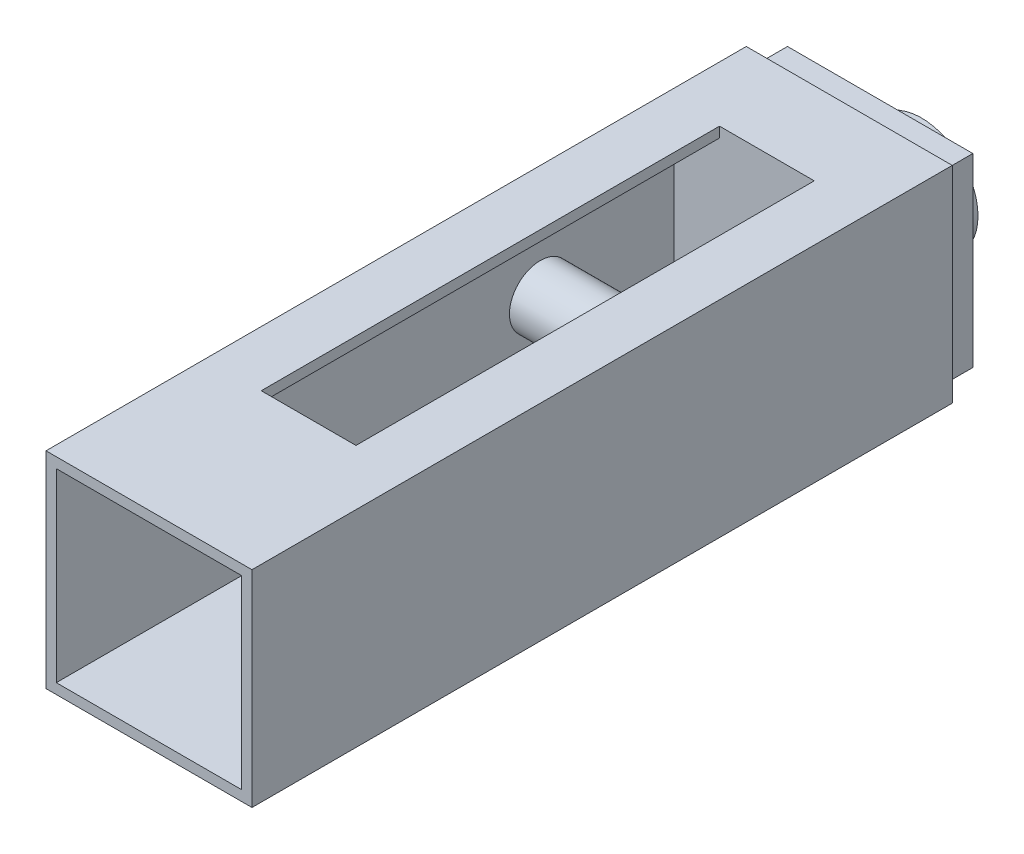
ISO-10303-21;
HEADER;
FILE_DESCRIPTION(('STEP AP214'),'2;1');
FILE_NAME('part.step','',(''),(''),'','','');
FILE_SCHEMA(('AUTOMOTIVE_DESIGN { 1 0 10303 214 1 1 1 1 }'));
ENDSEC;
DATA;
#1=APPLICATION_CONTEXT('core data for automotive mechanical design processes');
#2=APPLICATION_PROTOCOL_DEFINITION('international standard','automotive_design',2000,#1);
#3=PRODUCT_CONTEXT('',#1,'mechanical');
#4=PRODUCT('Part','Part','',(#3));
#5=PRODUCT_RELATED_PRODUCT_CATEGORY('part','',(#4));
#6=PRODUCT_DEFINITION_FORMATION('','',#4);
#7=PRODUCT_DEFINITION_CONTEXT('part definition',#1,'design');
#8=PRODUCT_DEFINITION('design','',#6,#7);
#9=PRODUCT_DEFINITION_SHAPE('','',#8);
#10=(LENGTH_UNIT() NAMED_UNIT(*) SI_UNIT(.MILLI.,.METRE.));
#11=(NAMED_UNIT(*) PLANE_ANGLE_UNIT() SI_UNIT($,.RADIAN.));
#12=(NAMED_UNIT(*) SI_UNIT($,.STERADIAN.) SOLID_ANGLE_UNIT());
#13=UNCERTAINTY_MEASURE_WITH_UNIT(LENGTH_MEASURE(1.E-05),#10,'distance_accuracy_value','');
#14=(GEOMETRIC_REPRESENTATION_CONTEXT(3) GLOBAL_UNCERTAINTY_ASSIGNED_CONTEXT((#13)) GLOBAL_UNIT_ASSIGNED_CONTEXT((#10,
#11,#12)) REPRESENTATION_CONTEXT('',''));
#15=CARTESIAN_POINT('',(0.,0.,0.));
#16=DIRECTION('',(0.,0.,1.));
#17=DIRECTION('',(1.,0.,0.));
#18=AXIS2_PLACEMENT_3D('',#15,#16,#17);
#19=CARTESIAN_POINT('',(4.048,-4.048,10.));
#20=DIRECTION('',(0.,0.,-1.));
#21=DIRECTION('',(-1.,0.,0.));
#22=AXIS2_PLACEMENT_3D('',#19,#20,#21);
#23=PLANE('',#22);
#24=CARTESIAN_POINT('',(0.,0.,10.));
#25=DIRECTION('',(0.,0.,-1.));
#26=DIRECTION('',(-1.,0.,0.));
#27=AXIS2_PLACEMENT_3D('',#24,#25,#26);
#28=CIRCLE('',#27,4.);
#29=CARTESIAN_POINT('',(-4.,0.,10.));
#30=VERTEX_POINT('',#29);
#31=EDGE_CURVE('E18',#30,#30,#28,.F.);
#32=ORIENTED_EDGE('',*,*,#31,.F.);
#33=EDGE_LOOP('',(#32));
#34=FACE_BOUND('',#33,.T.);
#35=ADVANCED_FACE('F14',(#34),#23,.T.);
#36=CARTESIAN_POINT('',(0.,0.,10.));
#37=DIRECTION('',(0.,0.,-1.));
#38=DIRECTION('',(-1.,0.,0.));
#39=AXIS2_PLACEMENT_3D('',#36,#37,#38);
#40=CYLINDRICAL_SURFACE('',#39,4.);
#41=CARTESIAN_POINT('',(0.,0.,0.));
#42=DIRECTION('',(0.,0.,-1.));
#43=DIRECTION('',(-1.,0.,0.));
#44=AXIS2_PLACEMENT_3D('',#41,#42,#43);
#45=CIRCLE('',#44,4.);
#46=CARTESIAN_POINT('',(-4.,0.,0.));
#47=VERTEX_POINT('',#46);
#48=EDGE_CURVE('E338',#47,#47,#45,.F.);
#49=ORIENTED_EDGE('',*,*,#48,.F.);
#50=EDGE_LOOP('',(#49));
#51=FACE_BOUND('',#50,.T.);
#52=ORIENTED_EDGE('',*,*,#31,.T.);
#53=EDGE_LOOP('',(#52));
#54=FACE_BOUND('',#53,.T.);
#55=ADVANCED_FACE('F345',(#51,#54),#40,.F.);
#56=CARTESIAN_POINT('',(-5.566,-5.566,0.));
#57=DIRECTION('',(0.,0.,1.));
#58=DIRECTION('',(1.,0.,0.));
#59=AXIS2_PLACEMENT_3D('',#56,#57,#58);
#60=PLANE('',#59);
#61=ORIENTED_EDGE('',*,*,#48,.T.);
#62=EDGE_LOOP('',(#61));
#63=FACE_BOUND('',#62,.T.);
#64=CARTESIAN_POINT('',(0.,0.,0.));
#65=DIRECTION('',(0.,0.,1.));
#66=DIRECTION('',(1.,0.,0.));
#67=AXIS2_PLACEMENT_3D('',#64,#65,#66);
#68=CIRCLE('',#67,5.5);
#69=CARTESIAN_POINT('',(5.5,0.,0.));
#70=VERTEX_POINT('',#69);
#71=EDGE_CURVE('E336',#70,#70,#68,.T.);
#72=ORIENTED_EDGE('',*,*,#71,.F.);
#73=EDGE_LOOP('',(#72));
#74=FACE_BOUND('',#73,.T.);
#75=ADVANCED_FACE('F355',(#63,#74),#60,.F.);
#76=CARTESIAN_POINT('',(0.,0.,0.));
#77=DIRECTION('',(0.,0.,1.));
#78=DIRECTION('',(1.,0.,0.));
#79=AXIS2_PLACEMENT_3D('',#76,#77,#78);
#80=CYLINDRICAL_SURFACE('',#79,5.5);
#81=ORIENTED_EDGE('',*,*,#71,.T.);
#82=EDGE_LOOP('',(#81));
#83=FACE_BOUND('',#82,.T.);
#84=CARTESIAN_POINT('',(0.,0.,4.));
#85=DIRECTION('',(0.,0.,1.));
#86=DIRECTION('',(1.,0.,0.));
#87=AXIS2_PLACEMENT_3D('',#84,#85,#86);
#88=CIRCLE('',#87,5.5);
#89=CARTESIAN_POINT('',(5.5,0.,4.));
#90=VERTEX_POINT('',#89);
#91=EDGE_CURVE('E329',#90,#90,#88,.T.);
#92=ORIENTED_EDGE('',*,*,#91,.F.);
#93=EDGE_LOOP('',(#92));
#94=FACE_BOUND('',#93,.T.);
#95=ADVANCED_FACE('F439',(#83,#94),#80,.T.);
#96=CARTESIAN_POINT('',(-9.,0.,28.));
#97=DIRECTION('',(1.,0.,0.));
#98=DIRECTION('',(0.,0.,-1.));
#99=AXIS2_PLACEMENT_3D('',#96,#97,#98);
#100=CYLINDRICAL_SURFACE('',#99,3.);
#101=CARTESIAN_POINT('',(9.,0.,28.));
#102=DIRECTION('',(1.,0.,0.));
#103=DIRECTION('',(0.,0.,-1.));
#104=AXIS2_PLACEMENT_3D('',#101,#102,#103);
#105=CIRCLE('',#104,3.);
#106=CARTESIAN_POINT('',(9.,0.,25.));
#107=VERTEX_POINT('',#106);
#108=EDGE_CURVE('E325',#107,#107,#105,.T.);
#109=ORIENTED_EDGE('',*,*,#108,.F.);
#110=EDGE_LOOP('',(#109));
#111=FACE_BOUND('',#110,.T.);
#112=CARTESIAN_POINT('',(-9.,0.,28.));
#113=DIRECTION('',(1.,0.,0.));
#114=DIRECTION('',(0.,0.,-1.));
#115=AXIS2_PLACEMENT_3D('',#112,#113,#114);
#116=CIRCLE('',#115,3.);
#117=CARTESIAN_POINT('',(-9.,0.,25.));
#118=VERTEX_POINT('',#117);
#119=EDGE_CURVE('E327',#118,#118,#116,.F.);
#120=ORIENTED_EDGE('',*,*,#119,.F.);
#121=EDGE_LOOP('',(#120));
#122=FACE_BOUND('',#121,.T.);
#123=ADVANCED_FACE('F435',(#111,#122),#100,.T.);
#124=CARTESIAN_POINT('',(9.,-9.,4.));
#125=DIRECTION('',(0.,0.,-1.));
#126=DIRECTION('',(-1.,0.,0.));
#127=AXIS2_PLACEMENT_3D('',#124,#125,#126);
#128=PLANE('',#127);
#129=ORIENTED_EDGE('',*,*,#91,.T.);
#130=EDGE_LOOP('',(#129));
#131=FACE_BOUND('',#130,.T.);
#132=DIRECTION('',(0.,-1.,0.));
#133=VECTOR('',#132,1.);
#134=CARTESIAN_POINT('',(-9.,0.,4.));
#135=LINE('',#134,#133);
#136=CARTESIAN_POINT('',(-9.,9.,4.));
#137=VERTEX_POINT('',#136);
#138=CARTESIAN_POINT('',(-9.,-9.,4.));
#139=VERTEX_POINT('',#138);
#140=EDGE_CURVE('E119',#137,#139,#135,.T.);
#141=ORIENTED_EDGE('',*,*,#140,.F.);
#142=DIRECTION('',(1.,0.,0.));
#143=VECTOR('',#142,1.);
#144=CARTESIAN_POINT('',(0.,9.,4.));
#145=LINE('',#144,#143);
#146=CARTESIAN_POINT('',(9.,9.,4.));
#147=VERTEX_POINT('',#146);
#148=EDGE_CURVE('E124',#147,#137,#145,.F.);
#149=ORIENTED_EDGE('',*,*,#148,.F.);
#150=DIRECTION('',(0.,-1.,0.));
#151=VECTOR('',#150,1.);
#152=CARTESIAN_POINT('',(9.,0.,4.));
#153=LINE('',#152,#151);
#154=CARTESIAN_POINT('',(9.,-9.,4.));
#155=VERTEX_POINT('',#154);
#156=EDGE_CURVE('E309',#155,#147,#153,.F.);
#157=ORIENTED_EDGE('',*,*,#156,.F.);
#158=DIRECTION('',(1.,0.,0.));
#159=VECTOR('',#158,1.);
#160=CARTESIAN_POINT('',(0.,-9.,4.));
#161=LINE('',#160,#159);
#162=EDGE_CURVE('E312',#139,#155,#161,.T.);
#163=ORIENTED_EDGE('',*,*,#162,.F.);
#164=EDGE_LOOP('',(#141,#149,#157,#163));
#165=FACE_BOUND('',#164,.T.);
#166=ADVANCED_FACE('F438',(#131,#165),#128,.T.);
#167=CARTESIAN_POINT('',(-9.,-9.,15.));
#168=DIRECTION('',(-1.,0.,0.));
#169=DIRECTION('',(0.,0.,1.));
#170=AXIS2_PLACEMENT_3D('',#167,#168,#169);
#171=PLANE('',#170);
#172=DIRECTION('',(0.,0.,1.));
#173=VECTOR('',#172,1.);
#174=CARTESIAN_POINT('',(-9.,-9.,41.));
#175=LINE('',#174,#173);
#176=CARTESIAN_POINT('',(-9.,-9.,75.));
#177=VERTEX_POINT('',#176);
#178=CARTESIAN_POINT('',(-9.,-9.,15.));
#179=VERTEX_POINT('',#178);
#180=EDGE_CURVE('E135',#177,#179,#175,.F.);
#181=ORIENTED_EDGE('',*,*,#180,.T.);
#182=DIRECTION('',(0.,1.,0.));
#183=VECTOR('',#182,1.);
#184=CARTESIAN_POINT('',(-9.,0.,15.));
#185=LINE('',#184,#183);
#186=CARTESIAN_POINT('',(-9.,9.,15.));
#187=VERTEX_POINT('',#186);
#188=EDGE_CURVE('E284',#187,#179,#185,.F.);
#189=ORIENTED_EDGE('',*,*,#188,.F.);
#190=DIRECTION('',(0.,0.,-1.));
#191=VECTOR('',#190,1.);
#192=CARTESIAN_POINT('',(-9.,9.,41.));
#193=LINE('',#192,#191);
#194=CARTESIAN_POINT('',(-9.,9.,75.));
#195=VERTEX_POINT('',#194);
#196=EDGE_CURVE('E322',#195,#187,#193,.T.);
#197=ORIENTED_EDGE('',*,*,#196,.F.);
#198=DIRECTION('',(0.,-1.,0.));
#199=VECTOR('',#198,1.);
#200=CARTESIAN_POINT('',(-9.,0.,75.));
#201=LINE('',#200,#199);
#202=EDGE_CURVE('E9',#195,#177,#201,.T.);
#203=ORIENTED_EDGE('',*,*,#202,.T.);
#204=EDGE_LOOP('',(#181,#189,#197,#203));
#205=FACE_BOUND('',#204,.T.);
#206=ORIENTED_EDGE('',*,*,#119,.T.);
#207=EDGE_LOOP('',(#206));
#208=FACE_BOUND('',#207,.T.);
#209=ADVANCED_FACE('F422',(#205,#208),#171,.F.);
#210=CARTESIAN_POINT('',(9.,-9.,15.));
#211=DIRECTION('',(-1.,0.,0.));
#212=DIRECTION('',(0.,0.,1.));
#213=AXIS2_PLACEMENT_3D('',#210,#211,#212);
#214=PLANE('',#213);
#215=DIRECTION('',(0.,0.,-1.));
#216=VECTOR('',#215,1.);
#217=CARTESIAN_POINT('',(9.,9.,41.));
#218=LINE('',#217,#216);
#219=CARTESIAN_POINT('',(9.,9.,75.));
#220=VERTEX_POINT('',#219);
#221=CARTESIAN_POINT('',(9.,9.,15.));
#222=VERTEX_POINT('',#221);
#223=EDGE_CURVE('E33',#220,#222,#218,.T.);
#224=ORIENTED_EDGE('',*,*,#223,.T.);
#225=DIRECTION('',(0.,-1.,0.));
#226=VECTOR('',#225,1.);
#227=CARTESIAN_POINT('',(9.,0.,15.));
#228=LINE('',#227,#226);
#229=CARTESIAN_POINT('',(9.,-9.,15.));
#230=VERTEX_POINT('',#229);
#231=EDGE_CURVE('E292',#230,#222,#228,.F.);
#232=ORIENTED_EDGE('',*,*,#231,.F.);
#233=DIRECTION('',(0.,0.,1.));
#234=VECTOR('',#233,1.);
#235=CARTESIAN_POINT('',(9.,-9.,41.));
#236=LINE('',#235,#234);
#237=CARTESIAN_POINT('',(9.,-9.,75.));
#238=VERTEX_POINT('',#237);
#239=EDGE_CURVE('E129',#238,#230,#236,.F.);
#240=ORIENTED_EDGE('',*,*,#239,.F.);
#241=DIRECTION('',(0.,-1.,0.));
#242=VECTOR('',#241,1.);
#243=CARTESIAN_POINT('',(9.,0.,75.));
#244=LINE('',#243,#242);
#245=EDGE_CURVE('E210',#238,#220,#244,.F.);
#246=ORIENTED_EDGE('',*,*,#245,.T.);
#247=EDGE_LOOP('',(#224,#232,#240,#246));
#248=FACE_BOUND('',#247,.T.);
#249=ORIENTED_EDGE('',*,*,#108,.T.);
#250=EDGE_LOOP('',(#249));
#251=FACE_BOUND('',#250,.T.);
#252=ADVANCED_FACE('F429',(#248,#251),#214,.T.);
#253=CARTESIAN_POINT('',(4.6,-9.,67.));
#254=DIRECTION('',(0.,-1.,0.));
#255=DIRECTION('',(0.,0.,-1.));
#256=AXIS2_PLACEMENT_3D('',#253,#254,#255);
#257=PLANE('',#256);
#258=DIRECTION('',(0.,0.,-1.));
#259=VECTOR('',#258,1.);
#260=CARTESIAN_POINT('',(4.6,-9.,41.));
#261=LINE('',#260,#259);
#262=CARTESIAN_POINT('',(4.6,-9.,59.5));
#263=VERTEX_POINT('',#262);
#264=CARTESIAN_POINT('',(4.6,-9.,15.));
#265=VERTEX_POINT('',#264);
#266=EDGE_CURVE('E301',#263,#265,#261,.T.);
#267=ORIENTED_EDGE('',*,*,#266,.F.);
#268=DIRECTION('',(1.,0.,0.));
#269=VECTOR('',#268,1.);
#270=CARTESIAN_POINT('',(-4.6,-9.,59.5));
#271=LINE('',#270,#269);
#272=CARTESIAN_POINT('',(-4.6,-9.,59.5));
#273=VERTEX_POINT('',#272);
#274=EDGE_CURVE('E185',#273,#263,#271,.T.);
#275=ORIENTED_EDGE('',*,*,#274,.F.);
#276=DIRECTION('',(0.,0.,1.));
#277=VECTOR('',#276,1.);
#278=CARTESIAN_POINT('',(-4.6,-9.,41.));
#279=LINE('',#278,#277);
#280=CARTESIAN_POINT('',(-4.6,-9.,15.));
#281=VERTEX_POINT('',#280);
#282=EDGE_CURVE('E299',#281,#273,#279,.T.);
#283=ORIENTED_EDGE('',*,*,#282,.F.);
#284=DIRECTION('',(-1.,0.,0.));
#285=VECTOR('',#284,1.);
#286=CARTESIAN_POINT('',(0.,-9.,15.));
#287=LINE('',#286,#285);
#288=EDGE_CURVE('E281',#179,#281,#287,.F.);
#289=ORIENTED_EDGE('',*,*,#288,.F.);
#290=ORIENTED_EDGE('',*,*,#180,.F.);
#291=DIRECTION('',(1.,0.,0.));
#292=VECTOR('',#291,1.);
#293=CARTESIAN_POINT('',(0.,-9.,75.));
#294=LINE('',#293,#292);
#295=EDGE_CURVE('E212',#177,#238,#294,.T.);
#296=ORIENTED_EDGE('',*,*,#295,.T.);
#297=ORIENTED_EDGE('',*,*,#239,.T.);
#298=DIRECTION('',(-1.,0.,0.));
#299=VECTOR('',#298,1.);
#300=CARTESIAN_POINT('',(0.,-9.,15.));
#301=LINE('',#300,#299);
#302=EDGE_CURVE('E295',#265,#230,#301,.F.);
#303=ORIENTED_EDGE('',*,*,#302,.F.);
#304=EDGE_LOOP('',(#267,#275,#283,#289,#290,#296,#297,#303));
#305=FACE_BOUND('',#304,.T.);
#306=ADVANCED_FACE('F425',(#305),#257,.F.);
#307=CARTESIAN_POINT('',(-9.,9.,67.));
#308=DIRECTION('',(0.,-1.,0.));
#309=DIRECTION('',(0.,0.,-1.));
#310=AXIS2_PLACEMENT_3D('',#307,#308,#309);
#311=PLANE('',#310);
#312=DIRECTION('',(0.,0.,-1.));
#313=VECTOR('',#312,1.);
#314=CARTESIAN_POINT('',(-4.6,9.,41.));
#315=LINE('',#314,#313);
#316=CARTESIAN_POINT('',(-4.6,9.,59.5));
#317=VERTEX_POINT('',#316);
#318=CARTESIAN_POINT('',(-4.6,9.,15.));
#319=VERTEX_POINT('',#318);
#320=EDGE_CURVE('E272',#317,#319,#315,.T.);
#321=ORIENTED_EDGE('',*,*,#320,.F.);
#322=DIRECTION('',(-1.,0.,0.));
#323=VECTOR('',#322,1.);
#324=CARTESIAN_POINT('',(4.6,9.,59.5));
#325=LINE('',#324,#323);
#326=CARTESIAN_POINT('',(4.6,9.,59.5));
#327=VERTEX_POINT('',#326);
#328=EDGE_CURVE('E206',#327,#317,#325,.T.);
#329=ORIENTED_EDGE('',*,*,#328,.F.);
#330=DIRECTION('',(0.,0.,1.));
#331=VECTOR('',#330,1.);
#332=CARTESIAN_POINT('',(4.6,9.,41.));
#333=LINE('',#332,#331);
#334=CARTESIAN_POINT('',(4.6,9.,15.));
#335=VERTEX_POINT('',#334);
#336=EDGE_CURVE('E274',#335,#327,#333,.T.);
#337=ORIENTED_EDGE('',*,*,#336,.F.);
#338=DIRECTION('',(1.,0.,0.));
#339=VECTOR('',#338,1.);
#340=CARTESIAN_POINT('',(0.,9.,15.));
#341=LINE('',#340,#339);
#342=EDGE_CURVE('E290',#222,#335,#341,.F.);
#343=ORIENTED_EDGE('',*,*,#342,.F.);
#344=ORIENTED_EDGE('',*,*,#223,.F.);
#345=DIRECTION('',(1.,0.,0.));
#346=VECTOR('',#345,1.);
#347=CARTESIAN_POINT('',(0.,9.,75.));
#348=LINE('',#347,#346);
#349=EDGE_CURVE('E24',#220,#195,#348,.F.);
#350=ORIENTED_EDGE('',*,*,#349,.T.);
#351=ORIENTED_EDGE('',*,*,#196,.T.);
#352=DIRECTION('',(1.,0.,0.));
#353=VECTOR('',#352,1.);
#354=CARTESIAN_POINT('',(0.,9.,15.));
#355=LINE('',#354,#353);
#356=EDGE_CURVE('E287',#319,#187,#355,.F.);
#357=ORIENTED_EDGE('',*,*,#356,.F.);
#358=EDGE_LOOP('',(#321,#329,#337,#343,#344,#350,#351,#357));
#359=FACE_BOUND('',#358,.T.);
#360=ADVANCED_FACE('F418',(#359),#311,.T.);
#361=CARTESIAN_POINT('',(-9.,9.,7.));
#362=DIRECTION('',(0.,-1.,0.));
#363=DIRECTION('',(0.,0.,-1.));
#364=AXIS2_PLACEMENT_3D('',#361,#362,#363);
#365=PLANE('',#364);
#366=DIRECTION('',(1.,0.,0.));
#367=VECTOR('',#366,1.);
#368=CARTESIAN_POINT('',(0.,9.,7.));
#369=LINE('',#368,#367);
#370=CARTESIAN_POINT('',(9.,9.,7.));
#371=VERTEX_POINT('',#370);
#372=CARTESIAN_POINT('',(-9.,9.,7.));
#373=VERTEX_POINT('',#372);
#374=EDGE_CURVE('E266',#371,#373,#369,.F.);
#375=ORIENTED_EDGE('',*,*,#374,.F.);
#376=DIRECTION('',(0.,0.,-1.));
#377=VECTOR('',#376,1.);
#378=CARTESIAN_POINT('',(9.,9.,5.5));
#379=LINE('',#378,#377);
#380=EDGE_CURVE('E306',#147,#371,#379,.F.);
#381=ORIENTED_EDGE('',*,*,#380,.F.);
#382=ORIENTED_EDGE('',*,*,#148,.T.);
#383=DIRECTION('',(0.,0.,-1.));
#384=VECTOR('',#383,1.);
#385=CARTESIAN_POINT('',(-9.,9.,5.5));
#386=LINE('',#385,#384);
#387=EDGE_CURVE('E319',#373,#137,#386,.T.);
#388=ORIENTED_EDGE('',*,*,#387,.F.);
#389=EDGE_LOOP('',(#375,#381,#382,#388));
#390=FACE_BOUND('',#389,.T.);
#391=ADVANCED_FACE('F455',(#390),#365,.F.);
#392=CARTESIAN_POINT('',(-9.,-9.,4.));
#393=DIRECTION('',(-1.,0.,0.));
#394=DIRECTION('',(0.,0.,1.));
#395=AXIS2_PLACEMENT_3D('',#392,#393,#394);
#396=PLANE('',#395);
#397=DIRECTION('',(0.,0.,-1.));
#398=VECTOR('',#397,1.);
#399=CARTESIAN_POINT('',(-9.,-9.,5.5));
#400=LINE('',#399,#398);
#401=CARTESIAN_POINT('',(-9.,-9.,7.));
#402=VERTEX_POINT('',#401);
#403=EDGE_CURVE('E315',#402,#139,#400,.T.);
#404=ORIENTED_EDGE('',*,*,#403,.F.);
#405=DIRECTION('',(0.,1.,0.));
#406=VECTOR('',#405,1.);
#407=CARTESIAN_POINT('',(-9.,0.,7.));
#408=LINE('',#407,#406);
#409=EDGE_CURVE('E263',#373,#402,#408,.F.);
#410=ORIENTED_EDGE('',*,*,#409,.F.);
#411=ORIENTED_EDGE('',*,*,#387,.T.);
#412=ORIENTED_EDGE('',*,*,#140,.T.);
#413=EDGE_LOOP('',(#404,#410,#411,#412));
#414=FACE_BOUND('',#413,.T.);
#415=ADVANCED_FACE('F458',(#414),#396,.T.);
#416=CARTESIAN_POINT('',(-9.,-9.,7.));
#417=DIRECTION('',(0.,-1.,0.));
#418=DIRECTION('',(0.,0.,-1.));
#419=AXIS2_PLACEMENT_3D('',#416,#417,#418);
#420=PLANE('',#419);
#421=DIRECTION('',(0.,0.,1.));
#422=VECTOR('',#421,1.);
#423=CARTESIAN_POINT('',(9.,-9.,5.5));
#424=LINE('',#423,#422);
#425=CARTESIAN_POINT('',(9.,-9.,7.));
#426=VERTEX_POINT('',#425);
#427=EDGE_CURVE('E303',#426,#155,#424,.F.);
#428=ORIENTED_EDGE('',*,*,#427,.F.);
#429=DIRECTION('',(-1.,0.,0.));
#430=VECTOR('',#429,1.);
#431=CARTESIAN_POINT('',(0.,-9.,7.));
#432=LINE('',#431,#430);
#433=EDGE_CURVE('E260',#402,#426,#432,.F.);
#434=ORIENTED_EDGE('',*,*,#433,.F.);
#435=ORIENTED_EDGE('',*,*,#403,.T.);
#436=ORIENTED_EDGE('',*,*,#162,.T.);
#437=EDGE_LOOP('',(#428,#434,#435,#436));
#438=FACE_BOUND('',#437,.T.);
#439=ADVANCED_FACE('F461',(#438),#420,.T.);
#440=CARTESIAN_POINT('',(9.,-9.,4.));
#441=DIRECTION('',(-1.,0.,0.));
#442=DIRECTION('',(0.,0.,1.));
#443=AXIS2_PLACEMENT_3D('',#440,#441,#442);
#444=PLANE('',#443);
#445=DIRECTION('',(0.,-1.,0.));
#446=VECTOR('',#445,1.);
#447=CARTESIAN_POINT('',(9.,0.,7.));
#448=LINE('',#447,#446);
#449=EDGE_CURVE('E257',#426,#371,#448,.F.);
#450=ORIENTED_EDGE('',*,*,#449,.F.);
#451=ORIENTED_EDGE('',*,*,#427,.T.);
#452=ORIENTED_EDGE('',*,*,#156,.T.);
#453=ORIENTED_EDGE('',*,*,#380,.T.);
#454=EDGE_LOOP('',(#450,#451,#452,#453));
#455=FACE_BOUND('',#454,.T.);
#456=ADVANCED_FACE('F464',(#455),#444,.F.);
#457=CARTESIAN_POINT('',(4.6,-10.,15.));
#458=DIRECTION('',(-1.,0.,0.));
#459=DIRECTION('',(0.,0.,1.));
#460=AXIS2_PLACEMENT_3D('',#457,#458,#459);
#461=PLANE('',#460);
#462=DIRECTION('',(0.,0.,-1.));
#463=VECTOR('',#462,1.);
#464=CARTESIAN_POINT('',(4.6,-10.,41.));
#465=LINE('',#464,#463);
#466=CARTESIAN_POINT('',(4.6,-10.,59.5));
#467=VERTEX_POINT('',#466);
#468=CARTESIAN_POINT('',(4.6,-10.,15.));
#469=VERTEX_POINT('',#468);
#470=EDGE_CURVE('E165',#467,#469,#465,.T.);
#471=ORIENTED_EDGE('',*,*,#470,.F.);
#472=DIRECTION('',(0.,-1.,0.));
#473=VECTOR('',#472,1.);
#474=CARTESIAN_POINT('',(4.6,-9.,59.5));
#475=LINE('',#474,#473);
#476=EDGE_CURVE('E168',#263,#467,#475,.T.);
#477=ORIENTED_EDGE('',*,*,#476,.F.);
#478=ORIENTED_EDGE('',*,*,#266,.T.);
#479=DIRECTION('',(0.,-1.,0.));
#480=VECTOR('',#479,1.);
#481=CARTESIAN_POINT('',(4.6,0.,15.));
#482=LINE('',#481,#480);
#483=EDGE_CURVE('E171',#469,#265,#482,.F.);
#484=ORIENTED_EDGE('',*,*,#483,.F.);
#485=EDGE_LOOP('',(#471,#477,#478,#484));
#486=FACE_BOUND('',#485,.T.);
#487=ADVANCED_FACE('F167',(#486),#461,.T.);
#488=CARTESIAN_POINT('',(-4.6,-10.,67.));
#489=DIRECTION('',(1.,0.,0.));
#490=DIRECTION('',(0.,0.,-1.));
#491=AXIS2_PLACEMENT_3D('',#488,#489,#490);
#492=PLANE('',#491);
#493=ORIENTED_EDGE('',*,*,#282,.T.);
#494=DIRECTION('',(0.,1.,0.));
#495=VECTOR('',#494,1.);
#496=CARTESIAN_POINT('',(-4.6,-10.,59.5));
#497=LINE('',#496,#495);
#498=CARTESIAN_POINT('',(-4.6,-10.,59.5));
#499=VERTEX_POINT('',#498);
#500=EDGE_CURVE('E192',#499,#273,#497,.T.);
#501=ORIENTED_EDGE('',*,*,#500,.F.);
#502=DIRECTION('',(0.,0.,1.));
#503=VECTOR('',#502,1.);
#504=CARTESIAN_POINT('',(-4.6,-10.,41.));
#505=LINE('',#504,#503);
#506=CARTESIAN_POINT('',(-4.6,-10.,15.));
#507=VERTEX_POINT('',#506);
#508=EDGE_CURVE('E190',#507,#499,#505,.T.);
#509=ORIENTED_EDGE('',*,*,#508,.F.);
#510=DIRECTION('',(0.,1.,0.));
#511=VECTOR('',#510,1.);
#512=CARTESIAN_POINT('',(-4.6,0.,15.));
#513=LINE('',#512,#511);
#514=EDGE_CURVE('E279',#281,#507,#513,.F.);
#515=ORIENTED_EDGE('',*,*,#514,.F.);
#516=EDGE_LOOP('',(#493,#501,#509,#515));
#517=FACE_BOUND('',#516,.T.);
#518=ADVANCED_FACE('F427',(#517),#492,.T.);
#519=CARTESIAN_POINT('',(9.,-10.,15.));
#520=DIRECTION('',(0.,0.,-1.));
#521=DIRECTION('',(-1.,0.,0.));
#522=AXIS2_PLACEMENT_3D('',#519,#520,#521);
#523=PLANE('',#522);
#524=ORIENTED_EDGE('',*,*,#514,.T.);
#525=DIRECTION('',(-1.,0.,0.));
#526=VECTOR('',#525,1.);
#527=CARTESIAN_POINT('',(0.,-10.,15.));
#528=LINE('',#527,#526);
#529=EDGE_CURVE('E176',#469,#507,#528,.T.);
#530=ORIENTED_EDGE('',*,*,#529,.F.);
#531=ORIENTED_EDGE('',*,*,#483,.T.);
#532=ORIENTED_EDGE('',*,*,#302,.T.);
#533=ORIENTED_EDGE('',*,*,#231,.T.);
#534=ORIENTED_EDGE('',*,*,#342,.T.);
#535=DIRECTION('',(0.,-1.,0.));
#536=VECTOR('',#535,1.);
#537=CARTESIAN_POINT('',(4.6,9.5,15.));
#538=LINE('',#537,#536);
#539=CARTESIAN_POINT('',(4.6,10.,15.));
#540=VERTEX_POINT('',#539);
#541=EDGE_CURVE('E276',#540,#335,#538,.T.);
#542=ORIENTED_EDGE('',*,*,#541,.F.);
#543=DIRECTION('',(1.,0.,0.));
#544=VECTOR('',#543,1.);
#545=CARTESIAN_POINT('',(0.,10.,15.));
#546=LINE('',#545,#544);
#547=CARTESIAN_POINT('',(-4.6,10.,15.));
#548=VERTEX_POINT('',#547);
#549=EDGE_CURVE('E239',#548,#540,#546,.T.);
#550=ORIENTED_EDGE('',*,*,#549,.F.);
#551=DIRECTION('',(0.,1.,0.));
#552=VECTOR('',#551,1.);
#553=CARTESIAN_POINT('',(-4.6,9.5,15.));
#554=LINE('',#553,#552);
#555=EDGE_CURVE('E269',#319,#548,#554,.T.);
#556=ORIENTED_EDGE('',*,*,#555,.F.);
#557=ORIENTED_EDGE('',*,*,#356,.T.);
#558=ORIENTED_EDGE('',*,*,#188,.T.);
#559=ORIENTED_EDGE('',*,*,#288,.T.);
#560=EDGE_LOOP('',(#524,#530,#531,#532,#533,#534,#542,#550,#556,#557,#558,#559));
#561=FACE_BOUND('',#560,.T.);
#562=ADVANCED_FACE('F415',(#561),#523,.F.);
#563=CARTESIAN_POINT('',(4.6,9.,15.));
#564=DIRECTION('',(-1.,0.,0.));
#565=DIRECTION('',(0.,0.,1.));
#566=AXIS2_PLACEMENT_3D('',#563,#564,#565);
#567=PLANE('',#566);
#568=ORIENTED_EDGE('',*,*,#336,.T.);
#569=DIRECTION('',(0.,-1.,0.));
#570=VECTOR('',#569,1.);
#571=CARTESIAN_POINT('',(4.6,10.,59.5));
#572=LINE('',#571,#570);
#573=CARTESIAN_POINT('',(4.6,10.,59.5));
#574=VERTEX_POINT('',#573);
#575=EDGE_CURVE('E203',#574,#327,#572,.T.);
#576=ORIENTED_EDGE('',*,*,#575,.F.);
#577=DIRECTION('',(0.,0.,1.));
#578=VECTOR('',#577,1.);
#579=CARTESIAN_POINT('',(4.6,10.,41.));
#580=LINE('',#579,#578);
#581=EDGE_CURVE('E237',#540,#574,#580,.T.);
#582=ORIENTED_EDGE('',*,*,#581,.F.);
#583=ORIENTED_EDGE('',*,*,#541,.T.);
#584=EDGE_LOOP('',(#568,#576,#582,#583));
#585=FACE_BOUND('',#584,.T.);
#586=ADVANCED_FACE('F394',(#585),#567,.T.);
#587=CARTESIAN_POINT('',(-4.6,9.,67.));
#588=DIRECTION('',(1.,0.,0.));
#589=DIRECTION('',(0.,0.,-1.));
#590=AXIS2_PLACEMENT_3D('',#587,#588,#589);
#591=PLANE('',#590);
#592=DIRECTION('',(0.,0.,-1.));
#593=VECTOR('',#592,1.);
#594=CARTESIAN_POINT('',(-4.6,10.,41.));
#595=LINE('',#594,#593);
#596=CARTESIAN_POINT('',(-4.6,10.,59.5));
#597=VERTEX_POINT('',#596);
#598=EDGE_CURVE('E235',#597,#548,#595,.T.);
#599=ORIENTED_EDGE('',*,*,#598,.F.);
#600=DIRECTION('',(0.,1.,0.));
#601=VECTOR('',#600,1.);
#602=CARTESIAN_POINT('',(-4.6,9.,59.5));
#603=LINE('',#602,#601);
#604=EDGE_CURVE('E197',#317,#597,#603,.T.);
#605=ORIENTED_EDGE('',*,*,#604,.F.);
#606=ORIENTED_EDGE('',*,*,#320,.T.);
#607=ORIENTED_EDGE('',*,*,#555,.T.);
#608=EDGE_LOOP('',(#599,#605,#606,#607));
#609=FACE_BOUND('',#608,.T.);
#610=ADVANCED_FACE('F385',(#609),#591,.T.);
#611=CARTESIAN_POINT('',(-10.,10.,7.));
#612=DIRECTION('',(0.,0.,1.));
#613=DIRECTION('',(0.,-1.,0.));
#614=AXIS2_PLACEMENT_3D('',#611,#612,#613);
#615=PLANE('',#614);
#616=ORIENTED_EDGE('',*,*,#433,.T.);
#617=ORIENTED_EDGE('',*,*,#449,.T.);
#618=ORIENTED_EDGE('',*,*,#374,.T.);
#619=ORIENTED_EDGE('',*,*,#409,.T.);
#620=EDGE_LOOP('',(#616,#617,#618,#619));
#621=FACE_BOUND('',#620,.T.);
#622=DIRECTION('',(-1.,0.,0.));
#623=VECTOR('',#622,1.);
#624=CARTESIAN_POINT('',(0.,10.,7.));
#625=LINE('',#624,#623);
#626=CARTESIAN_POINT('',(10.,10.,7.));
#627=VERTEX_POINT('',#626);
#628=CARTESIAN_POINT('',(-10.,10.,7.));
#629=VERTEX_POINT('',#628);
#630=EDGE_CURVE('E245',#627,#629,#625,.T.);
#631=ORIENTED_EDGE('',*,*,#630,.F.);
#632=DIRECTION('',(0.,-1.,0.));
#633=VECTOR('',#632,1.);
#634=CARTESIAN_POINT('',(10.,0.,7.));
#635=LINE('',#634,#633);
#636=CARTESIAN_POINT('',(10.,-10.,7.));
#637=VERTEX_POINT('',#636);
#638=EDGE_CURVE('E248',#637,#627,#635,.F.);
#639=ORIENTED_EDGE('',*,*,#638,.F.);
#640=DIRECTION('',(1.,0.,0.));
#641=VECTOR('',#640,1.);
#642=CARTESIAN_POINT('',(0.,-10.,7.));
#643=LINE('',#642,#641);
#644=CARTESIAN_POINT('',(-10.,-10.,7.));
#645=VERTEX_POINT('',#644);
#646=EDGE_CURVE('E177',#645,#637,#643,.T.);
#647=ORIENTED_EDGE('',*,*,#646,.F.);
#648=DIRECTION('',(0.,1.,0.));
#649=VECTOR('',#648,1.);
#650=CARTESIAN_POINT('',(-10.,0.,7.));
#651=LINE('',#650,#649);
#652=EDGE_CURVE('E232',#629,#645,#651,.F.);
#653=ORIENTED_EDGE('',*,*,#652,.F.);
#654=EDGE_LOOP('',(#631,#639,#647,#653));
#655=FACE_BOUND('',#654,.T.);
#656=ADVANCED_FACE('F383',(#621,#655),#615,.F.);
#657=CARTESIAN_POINT('',(-10.,-10.,7.));
#658=DIRECTION('',(0.,-1.,0.));
#659=DIRECTION('',(1.,0.,0.));
#660=AXIS2_PLACEMENT_3D('',#657,#658,#659);
#661=PLANE('',#660);
#662=DIRECTION('',(-1.,0.,0.));
#663=VECTOR('',#662,1.);
#664=CARTESIAN_POINT('',(4.6,-10.,59.5));
#665=LINE('',#664,#663);
#666=EDGE_CURVE('E183',#467,#499,#665,.T.);
#667=ORIENTED_EDGE('',*,*,#666,.F.);
#668=ORIENTED_EDGE('',*,*,#470,.T.);
#669=ORIENTED_EDGE('',*,*,#529,.T.);
#670=ORIENTED_EDGE('',*,*,#508,.T.);
#671=EDGE_LOOP('',(#667,#668,#669,#670));
#672=FACE_BOUND('',#671,.T.);
#673=ORIENTED_EDGE('',*,*,#646,.T.);
#674=DIRECTION('',(0.,0.,1.));
#675=VECTOR('',#674,1.);
#676=CARTESIAN_POINT('',(10.,-10.,41.));
#677=LINE('',#676,#675);
#678=CARTESIAN_POINT('',(10.,-10.,75.));
#679=VERTEX_POINT('',#678);
#680=EDGE_CURVE('E251',#679,#637,#677,.F.);
#681=ORIENTED_EDGE('',*,*,#680,.F.);
#682=DIRECTION('',(1.,0.,0.));
#683=VECTOR('',#682,1.);
#684=CARTESIAN_POINT('',(0.,-10.,75.));
#685=LINE('',#684,#683);
#686=CARTESIAN_POINT('',(-10.,-10.,75.));
#687=VERTEX_POINT('',#686);
#688=EDGE_CURVE('E223',#687,#679,#685,.T.);
#689=ORIENTED_EDGE('',*,*,#688,.F.);
#690=DIRECTION('',(0.,0.,-1.));
#691=VECTOR('',#690,1.);
#692=CARTESIAN_POINT('',(-10.,-10.,41.));
#693=LINE('',#692,#691);
#694=EDGE_CURVE('E229',#645,#687,#693,.F.);
#695=ORIENTED_EDGE('',*,*,#694,.F.);
#696=EDGE_LOOP('',(#673,#681,#689,#695));
#697=FACE_BOUND('',#696,.T.);
#698=ADVANCED_FACE('F187',(#672,#697),#661,.T.);
#699=CARTESIAN_POINT('',(10.,-10.,7.));
#700=DIRECTION('',(-1.,0.,0.));
#701=DIRECTION('',(0.,0.,1.));
#702=AXIS2_PLACEMENT_3D('',#699,#700,#701);
#703=PLANE('',#702);
#704=ORIENTED_EDGE('',*,*,#638,.T.);
#705=DIRECTION('',(0.,0.,-1.));
#706=VECTOR('',#705,1.);
#707=CARTESIAN_POINT('',(10.,10.,41.));
#708=LINE('',#707,#706);
#709=CARTESIAN_POINT('',(10.,10.,75.));
#710=VERTEX_POINT('',#709);
#711=EDGE_CURVE('E242',#710,#627,#708,.T.);
#712=ORIENTED_EDGE('',*,*,#711,.F.);
#713=DIRECTION('',(0.,1.,0.));
#714=VECTOR('',#713,1.);
#715=CARTESIAN_POINT('',(10.,0.,75.));
#716=LINE('',#715,#714);
#717=EDGE_CURVE('E220',#679,#710,#716,.T.);
#718=ORIENTED_EDGE('',*,*,#717,.F.);
#719=ORIENTED_EDGE('',*,*,#680,.T.);
#720=EDGE_LOOP('',(#704,#712,#718,#719));
#721=FACE_BOUND('',#720,.T.);
#722=ADVANCED_FACE('F381',(#721),#703,.F.);
#723=CARTESIAN_POINT('',(-10.,10.,7.));
#724=DIRECTION('',(0.,1.,0.));
#725=DIRECTION('',(0.,0.,1.));
#726=AXIS2_PLACEMENT_3D('',#723,#724,#725);
#727=PLANE('',#726);
#728=DIRECTION('',(1.,0.,0.));
#729=VECTOR('',#728,1.);
#730=CARTESIAN_POINT('',(-4.6,10.,59.5));
#731=LINE('',#730,#729);
#732=EDGE_CURVE('E200',#597,#574,#731,.T.);
#733=ORIENTED_EDGE('',*,*,#732,.F.);
#734=ORIENTED_EDGE('',*,*,#598,.T.);
#735=ORIENTED_EDGE('',*,*,#549,.T.);
#736=ORIENTED_EDGE('',*,*,#581,.T.);
#737=EDGE_LOOP('',(#733,#734,#735,#736));
#738=FACE_BOUND('',#737,.T.);
#739=DIRECTION('',(-1.,0.,0.));
#740=VECTOR('',#739,1.);
#741=CARTESIAN_POINT('',(0.,10.,75.));
#742=LINE('',#741,#740);
#743=CARTESIAN_POINT('',(-10.,10.,75.));
#744=VERTEX_POINT('',#743);
#745=EDGE_CURVE('E217',#710,#744,#742,.T.);
#746=ORIENTED_EDGE('',*,*,#745,.F.);
#747=ORIENTED_EDGE('',*,*,#711,.T.);
#748=ORIENTED_EDGE('',*,*,#630,.T.);
#749=DIRECTION('',(0.,0.,1.));
#750=VECTOR('',#749,1.);
#751=CARTESIAN_POINT('',(-10.,10.,41.));
#752=LINE('',#751,#750);
#753=EDGE_CURVE('E226',#744,#629,#752,.F.);
#754=ORIENTED_EDGE('',*,*,#753,.F.);
#755=EDGE_LOOP('',(#746,#747,#748,#754));
#756=FACE_BOUND('',#755,.T.);
#757=ADVANCED_FACE('F368',(#738,#756),#727,.T.);
#758=CARTESIAN_POINT('',(-10.,-10.,7.));
#759=DIRECTION('',(1.,0.,0.));
#760=DIRECTION('',(0.,1.,0.));
#761=AXIS2_PLACEMENT_3D('',#758,#759,#760);
#762=PLANE('',#761);
#763=DIRECTION('',(0.,-1.,0.));
#764=VECTOR('',#763,1.);
#765=CARTESIAN_POINT('',(-10.,0.,75.));
#766=LINE('',#765,#764);
#767=EDGE_CURVE('E214',#744,#687,#766,.T.);
#768=ORIENTED_EDGE('',*,*,#767,.F.);
#769=ORIENTED_EDGE('',*,*,#753,.T.);
#770=ORIENTED_EDGE('',*,*,#652,.T.);
#771=ORIENTED_EDGE('',*,*,#694,.T.);
#772=EDGE_LOOP('',(#768,#769,#770,#771));
#773=FACE_BOUND('',#772,.T.);
#774=ADVANCED_FACE('F362',(#773),#762,.F.);
#775=CARTESIAN_POINT('',(-10.,-10.,75.));
#776=DIRECTION('',(0.,0.,1.));
#777=DIRECTION('',(1.,0.,0.));
#778=AXIS2_PLACEMENT_3D('',#775,#776,#777);
#779=PLANE('',#778);
#780=ORIENTED_EDGE('',*,*,#245,.F.);
#781=ORIENTED_EDGE('',*,*,#295,.F.);
#782=ORIENTED_EDGE('',*,*,#202,.F.);
#783=ORIENTED_EDGE('',*,*,#349,.F.);
#784=EDGE_LOOP('',(#780,#781,#782,#783));
#785=FACE_BOUND('',#784,.T.);
#786=ORIENTED_EDGE('',*,*,#745,.T.);
#787=ORIENTED_EDGE('',*,*,#767,.T.);
#788=ORIENTED_EDGE('',*,*,#688,.T.);
#789=ORIENTED_EDGE('',*,*,#717,.T.);
#790=EDGE_LOOP('',(#786,#787,#788,#789));
#791=FACE_BOUND('',#790,.T.);
#792=ADVANCED_FACE('F16',(#785,#791),#779,.T.);
#793=CARTESIAN_POINT('',(0.,0.,59.5));
#794=DIRECTION('',(0.,0.,-1.));
#795=DIRECTION('',(-1.,0.,0.));
#796=AXIS2_PLACEMENT_3D('',#793,#794,#795);
#797=PLANE('',#796);
#798=ORIENTED_EDGE('',*,*,#604,.T.);
#799=ORIENTED_EDGE('',*,*,#732,.T.);
#800=ORIENTED_EDGE('',*,*,#575,.T.);
#801=ORIENTED_EDGE('',*,*,#328,.T.);
#802=EDGE_LOOP('',(#798,#799,#800,#801));
#803=FACE_BOUND('',#802,.T.);
#804=ADVANCED_FACE('F349',(#803),#797,.T.);
#805=CARTESIAN_POINT('',(0.,0.,59.5));
#806=DIRECTION('',(0.,0.,-1.));
#807=DIRECTION('',(-1.,0.,0.));
#808=AXIS2_PLACEMENT_3D('',#805,#806,#807);
#809=PLANE('',#808);
#810=ORIENTED_EDGE('',*,*,#476,.T.);
#811=ORIENTED_EDGE('',*,*,#666,.T.);
#812=ORIENTED_EDGE('',*,*,#500,.T.);
#813=ORIENTED_EDGE('',*,*,#274,.T.);
#814=EDGE_LOOP('',(#810,#811,#812,#813));
#815=FACE_BOUND('',#814,.T.);
#816=ADVANCED_FACE('F181',(#815),#809,.T.);
#817=CLOSED_SHELL('',(#35,#55,#75,#95,#123,#166,#209,#252,#306,#360,#391,#415,#439,#456,#487,
#518,#562,#586,#610,#656,#698,#722,#757,#774,#792,#804,#816));
#818=MANIFOLD_SOLID_BREP('B1',#817);
#819=ADVANCED_BREP_SHAPE_REPRESENTATION('',(#18,#818),#14);
#820=SHAPE_DEFINITION_REPRESENTATION(#9,#819);
ENDSEC;
END-ISO-10303-21;
